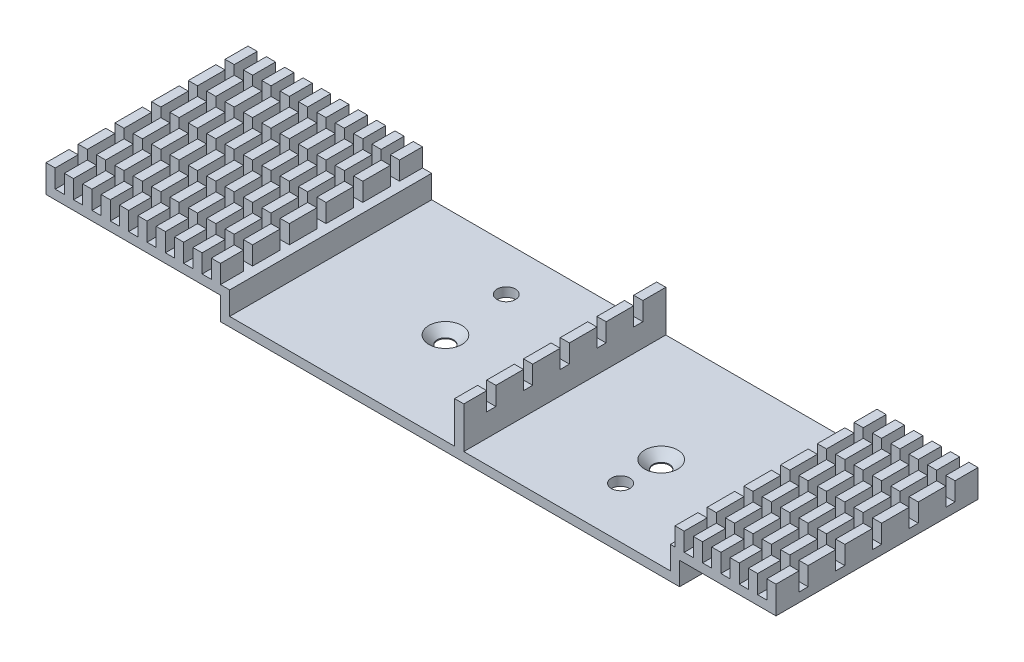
from build123d import *

# Parameters (mm, degrees)
ESQUISSE1_W                                  = 49
ESQUISSE1_H                                  = 22
BOSS_EXTRU_1_DEPTH                           = 1
FRAISAGE_POUR_VIS_T_TE_FRAIS_E_M1_61_A_COUNT = 2
FRAISAGE_POUR_VIS_T_TE_FRAIS_E_M1_61_A_PITCH = 23.5
ESQUISSE4_R                                  = 1
ENL_V_MAT_EXTRU_1_DEPTH                      = 34.883070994
BOSS_EXTRU_2_DEPTH                           = 22
ESQUISSE6_W                                  = 1
ESQUISSE6_H                                  = 2
BOSS_EXTRU_3_DEPTH                           = 22
R_P_TITION_LIN_AIRE1_COUNT                   = 10
R_P_TITION_LIN_AIRE1_PITCH                   = 2
BOSS_EXTRU_4_DEPTH                           = 22
ESQUISSE8_W                                  = 1
ESQUISSE8_H                                  = 2
BOSS_EXTRU_5_DEPTH                           = 22
R_P_TITION_LIN_AIRE2_COUNT                   = 6
R_P_TITION_LIN_AIRE2_PITCH                   = 2
ESQUISSE9_W                                  = 1
ESQUISSE9_H                                  = 4.5
BOSS_EXTRU_6_DEPTH                           = 22
ESQUISSE10_W                                 = 1
ESQUISSE10_H                                 = 2
ENL_V_MAT_EXTRU_2_DEPTH                      = 83.671034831
R_P_TITION_LIN_AIRE3_COUNT                   = 3
R_P_TITION_LIN_AIRE3_PITCH                   = 4
R_P_TITION_LIN_AIRE4_COPY_1_SKETCH_W         = 1
R_P_TITION_LIN_AIRE4_COPY_1_SKETCH_H         = 2
R_P_TITION_LIN_AIRE4_COPY_1_DEPTH            = 83.671034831
R_P_TITION_LIN_AIRE4_COPY_2_SKETCH_W         = 1
R_P_TITION_LIN_AIRE4_COPY_2_SKETCH_H         = 2
R_P_TITION_LIN_AIRE4_COPY_2_DEPTH            = 83.671034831
R_P_TITION_LIN_AIRE4_COPY_3_SKETCH_W         = 1
R_P_TITION_LIN_AIRE4_COPY_3_SKETCH_H         = 2
R_P_TITION_LIN_AIRE4_COPY_3_DEPTH            = 83.671034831
R_P_TITION_LIN_AIRE4_COPY_4_SKETCH_W         = 1
R_P_TITION_LIN_AIRE4_COPY_4_SKETCH_H         = 2
R_P_TITION_LIN_AIRE4_COPY_4_DEPTH            = 83.671034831
R_P_TITION_LIN_AIRE4_COPY_5_SKETCH_W         = 1
R_P_TITION_LIN_AIRE4_COPY_5_SKETCH_H         = 2
R_P_TITION_LIN_AIRE4_COPY_5_DEPTH            = 83.671034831
R_P_TITION_LIN_AIRE4_COPY_6_SKETCH_W         = 1
R_P_TITION_LIN_AIRE4_COPY_6_SKETCH_H         = 2
R_P_TITION_LIN_AIRE4_COPY_6_DEPTH            = 83.671034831


with BuildPart() as part:
    # Esquisse1 → Boss.-Extru.1 (new body)
    with BuildSketch(Plane(origin=(0, 0, 0), x_dir=(1, 0, 0), z_dir=(0, 1, 0))):
        with Locations((1.25, 11)):
            Rectangle(ESQUISSE1_W, ESQUISSE1_H)
    extrude(amount=BOSS_EXTRU_1_DEPTH)

    # Esquisse3 → Fraisage pour vis _ t_te frais_e M1.61 (revolve, cut)
    with BuildSketch(Plane(origin=(14.75, 1, -10), x_dir=(0, 0, 1), z_dir=(1, 0, 0))):
        Polygon((0, 0), (0, 1), (0.9, 1), (0.9, 0.9), (1.8, 0), align=None)
    fraisage_pour_vis_t_te_frais_e_m1_61 = revolve(axis=Axis((14.75, 7.35, -10), (0, -1, 0)), mode=Mode.SUBTRACT)

    # Fraisage pour vis _ t_te frais_e M1.61 a: Fraisage pour vis _ t_te frais_e M1.61 ×2
    with Locations(*[(-i * FRAISAGE_POUR_VIS_T_TE_FRAIS_E_M1_61_A_PITCH, 0, 0) for i in range(1, FRAISAGE_POUR_VIS_T_TE_FRAIS_E_M1_61_A_COUNT)]):
        add(fraisage_pour_vis_t_te_frais_e_m1_61, mode=Mode.SUBTRACT)

    # Esquisse4 → Enl_v. mat.-Extru.1 (cut, through all)
    with BuildSketch(Plane(origin=(0, 1, 0), x_dir=(1, 0, 0), z_dir=(0, 1, 0))):
        with Locations(Location((-9.275, 17.15, 0), (0, 0, 270))):
            Circle(ESQUISSE4_R)
        with Locations(Location((14.775, 5.55, 0), (0, 0, 270))):
            Circle(ESQUISSE4_R)
    extrude(amount=-ENL_V_MAT_EXTRU_1_DEPTH, mode=Mode.SUBTRACT)

    # Esquisse5 → Boss.-Extru.2 (add)
    with BuildSketch(Plane(origin=(0, 0, -22), x_dir=(-1, 0, 0), z_dir=(0, 0, -1))):
        Polygon((22.25, 1), (23.25, 1), (23.25, 2.5), (42.25, 2.5), (42.25, 3.5), (22.25, 3.5), align=None)
    extrude(amount=-BOSS_EXTRU_2_DEPTH)

    # Esquisse6 → Boss.-Extru.3 (add)
    with BuildSketch(Plane.XY):
        with Locations((-41.75, 4.5)):
            Rectangle(ESQUISSE6_W, ESQUISSE6_H)
    boss_extru_3 = extrude(amount=-BOSS_EXTRU_3_DEPTH)

    # R_p_tition lin_aire1: Boss.-Extru.3 ×10
    with Locations(*[(i * R_P_TITION_LIN_AIRE1_PITCH, 0, 0) for i in range(1, R_P_TITION_LIN_AIRE1_COUNT)]):
        add(boss_extru_3)

    # Esquisse7 → Boss.-Extru.4 (add)
    with BuildSketch(Plane.XY):
        Polygon((25.75, 0), (26.75, 0), (26.75, 2.5), (37.25, 2.5), (37.25, 3.5), (25.75, 3.5), align=None)
    extrude(amount=-BOSS_EXTRU_4_DEPTH)

    # Esquisse8 → Boss.-Extru.5 (add)
    with BuildSketch(Plane(origin=(0, 0, -22), x_dir=(-1, 0, 0), z_dir=(0, 0, -1))):
        with Locations((-36.75, 4.5)):
            Rectangle(ESQUISSE8_W, ESQUISSE8_H)
    boss_extru_5 = extrude(amount=-BOSS_EXTRU_5_DEPTH)

    # R_p_tition lin_aire2: Boss.-Extru.5 ×6
    with Locations(*[(-i * R_P_TITION_LIN_AIRE2_PITCH, 0, 0) for i in range(1, R_P_TITION_LIN_AIRE2_COUNT)]):
        add(boss_extru_5)

    # Esquisse9 → Boss.-Extru.6 (add)
    with BuildSketch(Plane(origin=(0, 0, -22), x_dir=(-1, 0, 0), z_dir=(0, 0, -1))):
        with Locations((-2.75, 3.25)):
            Rectangle(ESQUISSE9_W, ESQUISSE9_H)
    extrude(amount=-BOSS_EXTRU_6_DEPTH)

    # Esquisse10 → Enl_v. mat.-Extru.2 (cut, through all)
    with BuildSketch(Plane.ZY.offset(42.25)):
        with Locations((-11, 4.5)):
            Rectangle(ESQUISSE10_W, ESQUISSE10_H)
    enl_v_mat_extru_2 = extrude(amount=-ENL_V_MAT_EXTRU_2_DEPTH, mode=Mode.SUBTRACT)

    # R_p_tition lin_aire3: Enl_v. mat.-Extru.2 ×3
    with Locations(*[(0, 0, i * R_P_TITION_LIN_AIRE3_PITCH) for i in range(1, R_P_TITION_LIN_AIRE3_COUNT)]):
        add(enl_v_mat_extru_2, mode=Mode.SUBTRACT)

    # R_p_tition lin_aire4 copy 1 sketch → R_p_tition lin_aire4 copy 1 (cut, through all)
    with BuildSketch(Plane.ZY.offset(42.25)):
        with Locations((-11, 4.5)):
            Rectangle(R_P_TITION_LIN_AIRE4_COPY_1_SKETCH_W, R_P_TITION_LIN_AIRE4_COPY_1_SKETCH_H)
    extrude(amount=-R_P_TITION_LIN_AIRE4_COPY_1_DEPTH, mode=Mode.SUBTRACT)

    # R_p_tition lin_aire4 copy 2 sketch → R_p_tition lin_aire4 copy 2 (cut, through all)
    with BuildSketch(Plane(origin=(-42.25, 0, -4), x_dir=(0, 0, 1), z_dir=(-1, 0, 0))):
        with Locations((-11, 4.5)):
            Rectangle(R_P_TITION_LIN_AIRE4_COPY_2_SKETCH_W, R_P_TITION_LIN_AIRE4_COPY_2_SKETCH_H)
    extrude(amount=-R_P_TITION_LIN_AIRE4_COPY_2_DEPTH, mode=Mode.SUBTRACT)

    # R_p_tition lin_aire4 copy 3 sketch → R_p_tition lin_aire4 copy 3 (cut, through all)
    with BuildSketch(Plane(origin=(-42.25, 0, 4), x_dir=(0, 0, 1), z_dir=(-1, 0, 0))):
        with Locations((-11, 4.5)):
            Rectangle(R_P_TITION_LIN_AIRE4_COPY_3_SKETCH_W, R_P_TITION_LIN_AIRE4_COPY_3_SKETCH_H)
    extrude(amount=-R_P_TITION_LIN_AIRE4_COPY_3_DEPTH, mode=Mode.SUBTRACT)

    # R_p_tition lin_aire4 copy 4 sketch → R_p_tition lin_aire4 copy 4 (cut, through all)
    with BuildSketch(Plane.ZY.offset(42.25)):
        with Locations((-11, 4.5)):
            Rectangle(R_P_TITION_LIN_AIRE4_COPY_4_SKETCH_W, R_P_TITION_LIN_AIRE4_COPY_4_SKETCH_H)
    extrude(amount=-R_P_TITION_LIN_AIRE4_COPY_4_DEPTH, mode=Mode.SUBTRACT)

    # R_p_tition lin_aire4 copy 5 sketch → R_p_tition lin_aire4 copy 5 (cut, through all)
    with BuildSketch(Plane(origin=(-42.25, 0, -4), x_dir=(0, 0, 1), z_dir=(-1, 0, 0))):
        with Locations((-11, 4.5)):
            Rectangle(R_P_TITION_LIN_AIRE4_COPY_5_SKETCH_W, R_P_TITION_LIN_AIRE4_COPY_5_SKETCH_H)
    extrude(amount=-R_P_TITION_LIN_AIRE4_COPY_5_DEPTH, mode=Mode.SUBTRACT)

    # R_p_tition lin_aire4 copy 6 sketch → R_p_tition lin_aire4 copy 6 (cut, through all)
    with BuildSketch(Plane(origin=(-42.25, 0, -8), x_dir=(0, 0, 1), z_dir=(-1, 0, 0))):
        with Locations((-11, 4.5)):
            Rectangle(R_P_TITION_LIN_AIRE4_COPY_6_SKETCH_W, R_P_TITION_LIN_AIRE4_COPY_6_SKETCH_H)
    extrude(amount=-R_P_TITION_LIN_AIRE4_COPY_6_DEPTH, mode=Mode.SUBTRACT)


solid = part.part
